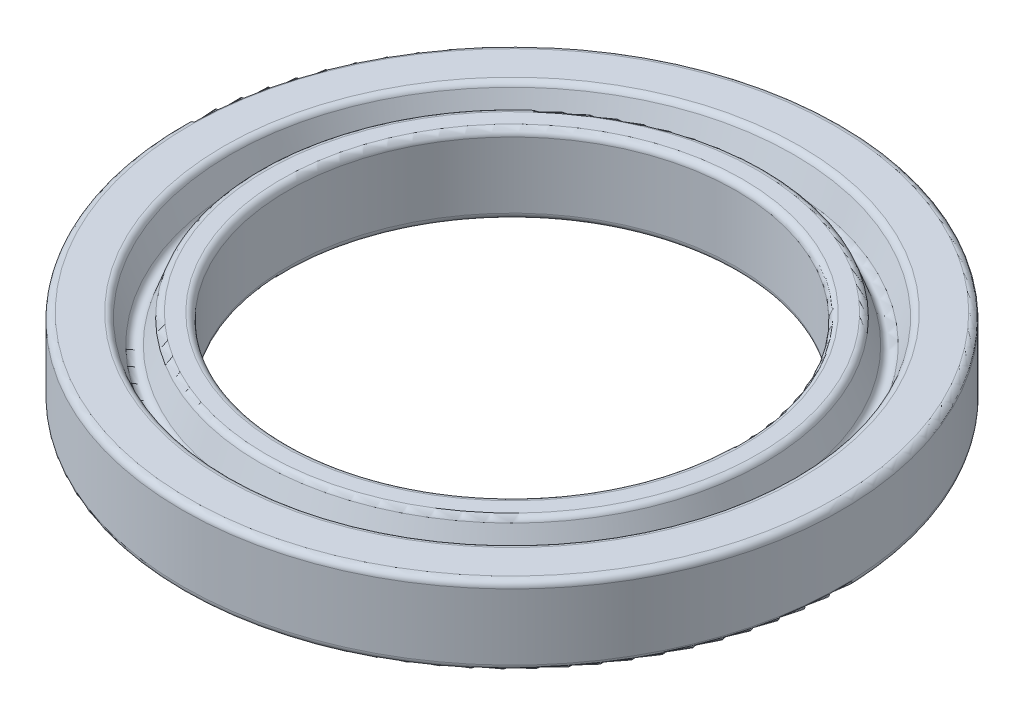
ISO-10303-21;
HEADER;
FILE_DESCRIPTION(('STEP AP214'),'2;1');
FILE_NAME('part.step','',(''),(''),'','','');
FILE_SCHEMA(('AUTOMOTIVE_DESIGN { 1 0 10303 214 1 1 1 1 }'));
ENDSEC;
DATA;
#1=APPLICATION_CONTEXT('core data for automotive mechanical design processes');
#2=APPLICATION_PROTOCOL_DEFINITION('international standard','automotive_design',2000,#1);
#3=PRODUCT_CONTEXT('',#1,'mechanical');
#4=PRODUCT('Part','Part','',(#3));
#5=PRODUCT_RELATED_PRODUCT_CATEGORY('part','',(#4));
#6=PRODUCT_DEFINITION_FORMATION('','',#4);
#7=PRODUCT_DEFINITION_CONTEXT('part definition',#1,'design');
#8=PRODUCT_DEFINITION('design','',#6,#7);
#9=PRODUCT_DEFINITION_SHAPE('','',#8);
#10=(LENGTH_UNIT() NAMED_UNIT(*) SI_UNIT(.MILLI.,.METRE.));
#11=(NAMED_UNIT(*) PLANE_ANGLE_UNIT() SI_UNIT($,.RADIAN.));
#12=(NAMED_UNIT(*) SI_UNIT($,.STERADIAN.) SOLID_ANGLE_UNIT());
#13=UNCERTAINTY_MEASURE_WITH_UNIT(LENGTH_MEASURE(1.E-05),#10,'distance_accuracy_value','');
#14=(GEOMETRIC_REPRESENTATION_CONTEXT(3) GLOBAL_UNCERTAINTY_ASSIGNED_CONTEXT((#13)) GLOBAL_UNIT_ASSIGNED_CONTEXT((#10,
#11,#12)) REPRESENTATION_CONTEXT('',''));
#15=CARTESIAN_POINT('',(0.,0.,0.));
#16=DIRECTION('',(0.,0.,1.));
#17=DIRECTION('',(1.,0.,0.));
#18=AXIS2_PLACEMENT_3D('',#15,#16,#17);
#19=CARTESIAN_POINT('',(0.,40.,0.));
#20=DIRECTION('',(0.,1.,0.));
#21=DIRECTION('',(0.,0.,1.));
#22=AXIS2_PLACEMENT_3D('',#19,#20,#21);
#23=CYLINDRICAL_SURFACE('',#22,8.50000000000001);
#24=CARTESIAN_POINT('',(0.,-0.25,0.));
#25=DIRECTION('',(0.,1.,0.));
#26=DIRECTION('',(0.,0.,1.));
#27=AXIS2_PLACEMENT_3D('',#24,#25,#26);
#28=CIRCLE('',#27,8.50000000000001);
#29=CARTESIAN_POINT('',(0.,-0.249999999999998,8.50000000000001));
#30=VERTEX_POINT('',#29);
#31=EDGE_CURVE('E62',#30,#30,#28,.F.);
#32=ORIENTED_EDGE('',*,*,#31,.T.);
#33=EDGE_LOOP('',(#32));
#34=FACE_BOUND('',#33,.T.);
#35=CARTESIAN_POINT('',(0.,2.25,0.));
#36=DIRECTION('',(0.,-1.,0.));
#37=DIRECTION('',(0.,0.,-1.));
#38=AXIS2_PLACEMENT_3D('',#35,#36,#37);
#39=CIRCLE('',#38,8.50000000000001);
#40=CARTESIAN_POINT('',(0.,2.25,-8.5));
#41=VERTEX_POINT('',#40);
#42=EDGE_CURVE('E65',#41,#41,#39,.F.);
#43=ORIENTED_EDGE('',*,*,#42,.T.);
#44=EDGE_LOOP('',(#43));
#45=FACE_BOUND('',#44,.T.);
#46=ADVANCED_FACE('F31',(#34,#45),#23,.F.);
#47=CARTESIAN_POINT('',(8.50000000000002,2.5,0.));
#48=DIRECTION('',(0.,-1.,0.));
#49=DIRECTION('',(0.,0.,-1.));
#50=AXIS2_PLACEMENT_3D('',#47,#48,#49);
#51=PLANE('',#50);
#52=CARTESIAN_POINT('',(0.,2.5,0.));
#53=DIRECTION('',(0.,-1.,0.));
#54=DIRECTION('',(0.,0.,-1.));
#55=AXIS2_PLACEMENT_3D('',#52,#53,#54);
#56=CIRCLE('',#55,9.32494811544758);
#57=CARTESIAN_POINT('',(0.,2.5,-9.32494811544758));
#58=VERTEX_POINT('',#57);
#59=EDGE_CURVE('E41',#58,#58,#56,.F.);
#60=ORIENTED_EDGE('',*,*,#59,.T.);
#61=EDGE_LOOP('',(#60));
#62=FACE_BOUND('',#61,.T.);
#63=CARTESIAN_POINT('',(0.,2.5,0.));
#64=DIRECTION('',(0.,-1.,0.));
#65=DIRECTION('',(0.,0.,-1.));
#66=AXIS2_PLACEMENT_3D('',#63,#64,#65);
#67=CIRCLE('',#66,8.75000000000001);
#68=CARTESIAN_POINT('',(0.,2.5,-8.75));
#69=VERTEX_POINT('',#68);
#70=EDGE_CURVE('E45',#69,#69,#67,.T.);
#71=ORIENTED_EDGE('',*,*,#70,.T.);
#72=EDGE_LOOP('',(#71));
#73=FACE_BOUND('',#72,.T.);
#74=ADVANCED_FACE('F113',(#62,#73),#51,.F.);
#75=CARTESIAN_POINT('',(0.,0.782826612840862,0.));
#76=DIRECTION('',(0.,-1.,0.));
#77=DIRECTION('',(0.,0.,-1.));
#78=AXIS2_PLACEMENT_3D('',#75,#76,#77);
#79=CONICAL_SURFACE('',#78,10.125,0.349065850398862);
#80=CARTESIAN_POINT('',(0.,1.42827267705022,0.));
#81=DIRECTION('',(0.,-1.,0.));
#82=DIRECTION('',(0.,0.,-1.));
#83=AXIS2_PLACEMENT_3D('',#80,#81,#82);
#84=CIRCLE('',#83,9.89007684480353);
#85=CARTESIAN_POINT('',(0.,1.42827267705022,-9.89007684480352));
#86=VERTEX_POINT('',#85);
#87=EDGE_CURVE('E80',#86,#86,#84,.F.);
#88=ORIENTED_EDGE('',*,*,#87,.T.);
#89=EDGE_LOOP('',(#88));
#90=FACE_BOUND('',#89,.T.);
#91=CARTESIAN_POINT('',(0.,2.33550503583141,0.));
#92=DIRECTION('',(0.,1.,0.));
#93=DIRECTION('',(0.,0.,1.));
#94=AXIS2_PLACEMENT_3D('',#91,#92,#93);
#95=CIRCLE('',#94,9.55987127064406);
#96=CARTESIAN_POINT('',(0.,2.33550503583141,9.55987127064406));
#97=VERTEX_POINT('',#96);
#98=EDGE_CURVE('E83',#97,#97,#95,.F.);
#99=ORIENTED_EDGE('',*,*,#98,.T.);
#100=EDGE_LOOP('',(#99));
#101=FACE_BOUND('',#100,.T.);
#102=ADVANCED_FACE('F118',(#90,#101),#79,.T.);
#103=CARTESIAN_POINT('',(0.,2.5,0.));
#104=DIRECTION('',(0.,1.,0.));
#105=DIRECTION('',(0.,0.,1.));
#106=AXIS2_PLACEMENT_3D('',#103,#104,#105);
#107=CONICAL_SURFACE('',#106,10.75,0.349065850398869);
#108=CARTESIAN_POINT('',(0.,1.42827267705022,0.));
#109=DIRECTION('',(0.,1.,0.));
#110=DIRECTION('',(0.,0.,1.));
#111=AXIS2_PLACEMENT_3D('',#108,#109,#110);
#112=CIRCLE('',#111,10.3599231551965);
#113=CARTESIAN_POINT('',(0.,1.42827267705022,10.3599231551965));
#114=VERTEX_POINT('',#113);
#115=EDGE_CURVE('E74',#114,#114,#112,.F.);
#116=ORIENTED_EDGE('',*,*,#115,.T.);
#117=EDGE_LOOP('',(#116));
#118=FACE_BOUND('',#117,.T.);
#119=CARTESIAN_POINT('',(0.,2.33550503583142,0.));
#120=DIRECTION('',(0.,-1.,0.));
#121=DIRECTION('',(0.,0.,-1.));
#122=AXIS2_PLACEMENT_3D('',#119,#120,#121);
#123=CIRCLE('',#122,10.690128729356);
#124=CARTESIAN_POINT('',(0.,2.33550503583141,-10.690128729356));
#125=VERTEX_POINT('',#124);
#126=EDGE_CURVE('E77',#125,#125,#123,.F.);
#127=ORIENTED_EDGE('',*,*,#126,.T.);
#128=EDGE_LOOP('',(#127));
#129=FACE_BOUND('',#128,.T.);
#130=ADVANCED_FACE('F180',(#118,#129),#107,.F.);
#131=CARTESIAN_POINT('',(10.75,2.49999999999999,0.));
#132=DIRECTION('',(0.,-1.,0.));
#133=DIRECTION('',(0.,0.,-1.));
#134=AXIS2_PLACEMENT_3D('',#131,#132,#133);
#135=PLANE('',#134);
#136=CARTESIAN_POINT('',(0.,2.5,0.));
#137=DIRECTION('',(0.,-1.,0.));
#138=DIRECTION('',(0.,0.,-1.));
#139=AXIS2_PLACEMENT_3D('',#136,#137,#138);
#140=CIRCLE('',#139,12.25);
#141=CARTESIAN_POINT('',(0.,2.5,-12.25));
#142=VERTEX_POINT('',#141);
#143=EDGE_CURVE('E56',#142,#142,#140,.F.);
#144=ORIENTED_EDGE('',*,*,#143,.T.);
#145=EDGE_LOOP('',(#144));
#146=FACE_BOUND('',#145,.T.);
#147=CARTESIAN_POINT('',(0.,2.5,0.));
#148=DIRECTION('',(0.,-1.,0.));
#149=DIRECTION('',(0.,0.,-1.));
#150=AXIS2_PLACEMENT_3D('',#147,#148,#149);
#151=CIRCLE('',#150,10.9250518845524);
#152=CARTESIAN_POINT('',(0.,2.5,-10.9250518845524));
#153=VERTEX_POINT('',#152);
#154=EDGE_CURVE('E59',#153,#153,#151,.T.);
#155=ORIENTED_EDGE('',*,*,#154,.T.);
#156=EDGE_LOOP('',(#155));
#157=FACE_BOUND('',#156,.T.);
#158=ADVANCED_FACE('F176',(#146,#157),#135,.F.);
#159=CARTESIAN_POINT('',(0.,40.,0.));
#160=DIRECTION('',(0.,1.,0.));
#161=DIRECTION('',(0.,0.,1.));
#162=AXIS2_PLACEMENT_3D('',#159,#160,#161);
#163=CYLINDRICAL_SURFACE('',#162,12.5);
#164=CARTESIAN_POINT('',(0.,2.25,0.));
#165=DIRECTION('',(0.,-1.,0.));
#166=DIRECTION('',(0.,0.,-1.));
#167=AXIS2_PLACEMENT_3D('',#164,#165,#166);
#168=CIRCLE('',#167,12.5);
#169=CARTESIAN_POINT('',(0.,2.25,-12.5));
#170=VERTEX_POINT('',#169);
#171=EDGE_CURVE('E50',#170,#170,#168,.T.);
#172=ORIENTED_EDGE('',*,*,#171,.T.);
#173=EDGE_LOOP('',(#172));
#174=FACE_BOUND('',#173,.T.);
#175=CARTESIAN_POINT('',(0.,-0.25,0.));
#176=DIRECTION('',(0.,1.,0.));
#177=DIRECTION('',(0.,0.,1.));
#178=AXIS2_PLACEMENT_3D('',#175,#176,#177);
#179=CIRCLE('',#178,12.5);
#180=CARTESIAN_POINT('',(0.,-0.249999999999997,12.5));
#181=VERTEX_POINT('',#180);
#182=EDGE_CURVE('E53',#181,#181,#179,.T.);
#183=ORIENTED_EDGE('',*,*,#182,.T.);
#184=EDGE_LOOP('',(#183));
#185=FACE_BOUND('',#184,.T.);
#186=ADVANCED_FACE('F173',(#174,#185),#163,.T.);
#187=CARTESIAN_POINT('',(11.5,-0.500000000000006,0.));
#188=DIRECTION('',(0.,1.,0.));
#189=DIRECTION('',(0.,0.,1.));
#190=AXIS2_PLACEMENT_3D('',#187,#188,#189);
#191=PLANE('',#190);
#192=CARTESIAN_POINT('',(0.,-0.5,0.));
#193=DIRECTION('',(0.,1.,0.));
#194=DIRECTION('',(0.,0.,1.));
#195=AXIS2_PLACEMENT_3D('',#192,#193,#194);
#196=CIRCLE('',#195,12.25);
#197=CARTESIAN_POINT('',(0.,-0.499999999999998,12.25));
#198=VERTEX_POINT('',#197);
#199=EDGE_CURVE('E10',#198,#198,#196,.F.);
#200=ORIENTED_EDGE('',*,*,#199,.T.);
#201=EDGE_LOOP('',(#200));
#202=FACE_BOUND('',#201,.T.);
#203=CARTESIAN_POINT('',(0.,-0.5,0.));
#204=DIRECTION('',(0.,1.,0.));
#205=DIRECTION('',(0.,0.,1.));
#206=AXIS2_PLACEMENT_3D('',#203,#204,#205);
#207=CIRCLE('',#206,11.6750518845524);
#208=CARTESIAN_POINT('',(0.,-0.499999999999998,11.6750518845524));
#209=VERTEX_POINT('',#208);
#210=EDGE_CURVE('E37',#209,#209,#207,.T.);
#211=ORIENTED_EDGE('',*,*,#210,.T.);
#212=EDGE_LOOP('',(#211));
#213=FACE_BOUND('',#212,.T.);
#214=ADVANCED_FACE('F169',(#202,#213),#191,.F.);
#215=CARTESIAN_POINT('',(0.,0.854359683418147,0.));
#216=DIRECTION('',(0.,-1.,0.));
#217=DIRECTION('',(0.,0.,-1.));
#218=AXIS2_PLACEMENT_3D('',#215,#216,#217);
#219=CONICAL_SURFACE('',#218,11.0070533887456,0.34906585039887);
#220=CARTESIAN_POINT('',(0.,0.218003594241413,0.));
#221=DIRECTION('',(0.,-1.,0.));
#222=DIRECTION('',(0.,0.,-1.));
#223=AXIS2_PLACEMENT_3D('',#220,#221,#222);
#224=CIRCLE('',#223,11.2386680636);
#225=CARTESIAN_POINT('',(0.,0.21800359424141,-11.2386680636));
#226=VERTEX_POINT('',#225);
#227=EDGE_CURVE('E92',#226,#226,#224,.F.);
#228=ORIENTED_EDGE('',*,*,#227,.T.);
#229=EDGE_LOOP('',(#228));
#230=FACE_BOUND('',#229,.T.);
#231=CARTESIAN_POINT('',(0.,-0.335505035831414,0.));
#232=DIRECTION('',(0.,1.,0.));
#233=DIRECTION('',(0.,0.,1.));
#234=AXIS2_PLACEMENT_3D('',#231,#232,#233);
#235=CIRCLE('',#234,11.440128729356);
#236=CARTESIAN_POINT('',(0.,-0.335505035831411,11.440128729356));
#237=VERTEX_POINT('',#236);
#238=EDGE_CURVE('E95',#237,#237,#235,.F.);
#239=ORIENTED_EDGE('',*,*,#238,.T.);
#240=EDGE_LOOP('',(#239));
#241=FACE_BOUND('',#240,.T.);
#242=ADVANCED_FACE('F99',(#230,#241),#219,.F.);
#243=CARTESIAN_POINT('',(0.,-0.5,0.));
#244=DIRECTION('',(0.,1.,0.));
#245=DIRECTION('',(0.,0.,1.));
#246=AXIS2_PLACEMENT_3D('',#243,#244,#245);
#247=CONICAL_SURFACE('',#246,10.5,0.358232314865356);
#248=CARTESIAN_POINT('',(0.,0.220153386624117,0.));
#249=DIRECTION('',(0.,1.,0.));
#250=DIRECTION('',(0.,0.,1.));
#251=AXIS2_PLACEMENT_3D('',#248,#249,#250);
#252=CIRCLE('',#251,10.7696153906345);
#253=CARTESIAN_POINT('',(0.,0.22015338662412,10.7696153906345));
#254=VERTEX_POINT('',#253);
#255=EDGE_CURVE('E86',#254,#254,#252,.F.);
#256=ORIENTED_EDGE('',*,*,#255,.T.);
#257=EDGE_LOOP('',(#256));
#258=FACE_BOUND('',#257,.T.);
#259=CARTESIAN_POINT('',(0.,-0.337654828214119,0.));
#260=DIRECTION('',(0.,-1.,0.));
#261=DIRECTION('',(0.,0.,-1.));
#262=AXIS2_PLACEMENT_3D('',#259,#260,#261);
#263=CIRCLE('',#262,10.5607797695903);
#264=CARTESIAN_POINT('',(0.,-0.337654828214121,-10.5607797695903));
#265=VERTEX_POINT('',#264);
#266=EDGE_CURVE('E89',#265,#265,#263,.F.);
#267=ORIENTED_EDGE('',*,*,#266,.T.);
#268=EDGE_LOOP('',(#267));
#269=FACE_BOUND('',#268,.T.);
#270=ADVANCED_FACE('F162',(#258,#269),#247,.T.);
#271=CARTESIAN_POINT('',(8.50000000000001,-0.5,0.));
#272=DIRECTION('',(0.,1.,0.));
#273=DIRECTION('',(0.,0.,1.));
#274=AXIS2_PLACEMENT_3D('',#271,#272,#273);
#275=PLANE('',#274);
#276=CARTESIAN_POINT('',(0.,-0.5,0.));
#277=DIRECTION('',(0.,1.,0.));
#278=DIRECTION('',(0.,0.,1.));
#279=AXIS2_PLACEMENT_3D('',#276,#277,#278);
#280=CIRCLE('',#279,10.3266502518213);
#281=CARTESIAN_POINT('',(0.,-0.499999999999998,10.3266502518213));
#282=VERTEX_POINT('',#281);
#283=EDGE_CURVE('E68',#282,#282,#280,.F.);
#284=ORIENTED_EDGE('',*,*,#283,.T.);
#285=EDGE_LOOP('',(#284));
#286=FACE_BOUND('',#285,.T.);
#287=CARTESIAN_POINT('',(0.,-0.5,0.));
#288=DIRECTION('',(0.,1.,0.));
#289=DIRECTION('',(0.,0.,1.));
#290=AXIS2_PLACEMENT_3D('',#287,#288,#289);
#291=CIRCLE('',#290,8.75000000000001);
#292=CARTESIAN_POINT('',(0.,-0.499999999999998,8.75000000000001));
#293=VERTEX_POINT('',#292);
#294=EDGE_CURVE('E71',#293,#293,#291,.T.);
#295=ORIENTED_EDGE('',*,*,#294,.T.);
#296=EDGE_LOOP('',(#295));
#297=FACE_BOUND('',#296,.T.);
#298=ADVANCED_FACE('F158',(#286,#297),#275,.F.);
#299=CARTESIAN_POINT('',(0.,0.132498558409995,0.));
#300=DIRECTION('',(0.,1.,0.));
#301=DIRECTION('',(0.,0.,1.));
#302=AXIS2_PLACEMENT_3D('',#299,#300,#301);
#303=TOROIDAL_SURFACE('',#302,11.0037449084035,0.25);
#304=ORIENTED_EDGE('',*,*,#255,.F.);
#305=EDGE_LOOP('',(#304));
#306=FACE_BOUND('',#305,.T.);
#307=ORIENTED_EDGE('',*,*,#227,.F.);
#308=EDGE_LOOP('',(#307));
#309=FACE_BOUND('',#308,.T.);
#310=ADVANCED_FACE('F154',(#306,#309),#303,.F.);
#311=CARTESIAN_POINT('',(0.,1.51377771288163,0.));
#312=DIRECTION('',(0.,1.,0.));
#313=DIRECTION('',(0.,0.,1.));
#314=AXIS2_PLACEMENT_3D('',#311,#312,#313);
#315=TOROIDAL_SURFACE('',#314,10.125,0.25);
#316=ORIENTED_EDGE('',*,*,#115,.F.);
#317=EDGE_LOOP('',(#316));
#318=FACE_BOUND('',#317,.T.);
#319=ORIENTED_EDGE('',*,*,#87,.F.);
#320=EDGE_LOOP('',(#319));
#321=FACE_BOUND('',#320,.T.);
#322=ADVANCED_FACE('F150',(#318,#321),#315,.F.);
#323=CARTESIAN_POINT('',(0.,-0.25,0.));
#324=DIRECTION('',(0.,1.,0.));
#325=DIRECTION('',(0.,0.,1.));
#326=AXIS2_PLACEMENT_3D('',#323,#324,#325);
#327=TOROIDAL_SURFACE('',#326,10.3266502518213,0.25);
#328=ORIENTED_EDGE('',*,*,#283,.F.);
#329=EDGE_LOOP('',(#328));
#330=FACE_BOUND('',#329,.T.);
#331=ORIENTED_EDGE('',*,*,#266,.F.);
#332=EDGE_LOOP('',(#331));
#333=FACE_BOUND('',#332,.T.);
#334=ADVANCED_FACE('F146',(#330,#333),#327,.T.);
#335=CARTESIAN_POINT('',(0.,-0.25,0.));
#336=DIRECTION('',(0.,1.,0.));
#337=DIRECTION('',(0.,0.,1.));
#338=AXIS2_PLACEMENT_3D('',#335,#336,#337);
#339=TOROIDAL_SURFACE('',#338,8.75000000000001,0.25);
#340=ORIENTED_EDGE('',*,*,#31,.F.);
#341=EDGE_LOOP('',(#340));
#342=FACE_BOUND('',#341,.T.);
#343=ORIENTED_EDGE('',*,*,#294,.F.);
#344=EDGE_LOOP('',(#343));
#345=FACE_BOUND('',#344,.T.);
#346=ADVANCED_FACE('F142',(#342,#345),#339,.T.);
#347=CARTESIAN_POINT('',(0.,2.25,0.));
#348=DIRECTION('',(0.,-1.,0.));
#349=DIRECTION('',(0.,0.,-1.));
#350=AXIS2_PLACEMENT_3D('',#347,#348,#349);
#351=TOROIDAL_SURFACE('',#350,12.25,0.25);
#352=ORIENTED_EDGE('',*,*,#171,.F.);
#353=EDGE_LOOP('',(#352));
#354=FACE_BOUND('',#353,.T.);
#355=ORIENTED_EDGE('',*,*,#143,.F.);
#356=EDGE_LOOP('',(#355));
#357=FACE_BOUND('',#356,.T.);
#358=ADVANCED_FACE('F138',(#354,#357),#351,.T.);
#359=CARTESIAN_POINT('',(0.,2.25,0.));
#360=DIRECTION('',(0.,-1.,0.));
#361=DIRECTION('',(0.,0.,-1.));
#362=AXIS2_PLACEMENT_3D('',#359,#360,#361);
#363=TOROIDAL_SURFACE('',#362,10.9250518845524,0.25);
#364=ORIENTED_EDGE('',*,*,#154,.F.);
#365=EDGE_LOOP('',(#364));
#366=FACE_BOUND('',#365,.T.);
#367=ORIENTED_EDGE('',*,*,#126,.F.);
#368=EDGE_LOOP('',(#367));
#369=FACE_BOUND('',#368,.T.);
#370=ADVANCED_FACE('F131',(#366,#369),#363,.T.);
#371=CARTESIAN_POINT('',(0.,2.25,0.));
#372=DIRECTION('',(0.,-1.,0.));
#373=DIRECTION('',(0.,0.,-1.));
#374=AXIS2_PLACEMENT_3D('',#371,#372,#373);
#375=TOROIDAL_SURFACE('',#374,9.32494811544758,0.25);
#376=ORIENTED_EDGE('',*,*,#98,.F.);
#377=EDGE_LOOP('',(#376));
#378=FACE_BOUND('',#377,.T.);
#379=ORIENTED_EDGE('',*,*,#59,.F.);
#380=EDGE_LOOP('',(#379));
#381=FACE_BOUND('',#380,.T.);
#382=ADVANCED_FACE('F125',(#378,#381),#375,.T.);
#383=CARTESIAN_POINT('',(0.,2.25,0.));
#384=DIRECTION('',(0.,-1.,0.));
#385=DIRECTION('',(0.,0.,-1.));
#386=AXIS2_PLACEMENT_3D('',#383,#384,#385);
#387=TOROIDAL_SURFACE('',#386,8.75000000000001,0.25);
#388=ORIENTED_EDGE('',*,*,#70,.F.);
#389=EDGE_LOOP('',(#388));
#390=FACE_BOUND('',#389,.T.);
#391=ORIENTED_EDGE('',*,*,#42,.F.);
#392=EDGE_LOOP('',(#391));
#393=FACE_BOUND('',#392,.T.);
#394=ADVANCED_FACE('F109',(#390,#393),#387,.T.);
#395=CARTESIAN_POINT('',(0.,-0.25,0.));
#396=DIRECTION('',(0.,1.,0.));
#397=DIRECTION('',(0.,0.,1.));
#398=AXIS2_PLACEMENT_3D('',#395,#396,#397);
#399=TOROIDAL_SURFACE('',#398,12.25,0.25);
#400=ORIENTED_EDGE('',*,*,#199,.F.);
#401=EDGE_LOOP('',(#400));
#402=FACE_BOUND('',#401,.T.);
#403=ORIENTED_EDGE('',*,*,#182,.F.);
#404=EDGE_LOOP('',(#403));
#405=FACE_BOUND('',#404,.T.);
#406=ADVANCED_FACE('F104',(#402,#405),#399,.T.);
#407=CARTESIAN_POINT('',(0.,-0.25,0.));
#408=DIRECTION('',(0.,1.,0.));
#409=DIRECTION('',(0.,0.,1.));
#410=AXIS2_PLACEMENT_3D('',#407,#408,#409);
#411=TOROIDAL_SURFACE('',#410,11.6750518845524,0.25);
#412=ORIENTED_EDGE('',*,*,#238,.F.);
#413=EDGE_LOOP('',(#412));
#414=FACE_BOUND('',#413,.T.);
#415=ORIENTED_EDGE('',*,*,#210,.F.);
#416=EDGE_LOOP('',(#415));
#417=FACE_BOUND('',#416,.T.);
#418=ADVANCED_FACE('F101',(#414,#417),#411,.T.);
#419=CLOSED_SHELL('',(#46,#74,#102,#130,#158,#186,#214,#242,#270,#298,#310,#322,#334,#346,#358,
#370,#382,#394,#406,#418));
#420=MANIFOLD_SOLID_BREP('B2',#419);
#421=ADVANCED_BREP_SHAPE_REPRESENTATION('',(#18,#420),#14);
#422=SHAPE_DEFINITION_REPRESENTATION(#9,#421);
ENDSEC;
END-ISO-10303-21;
